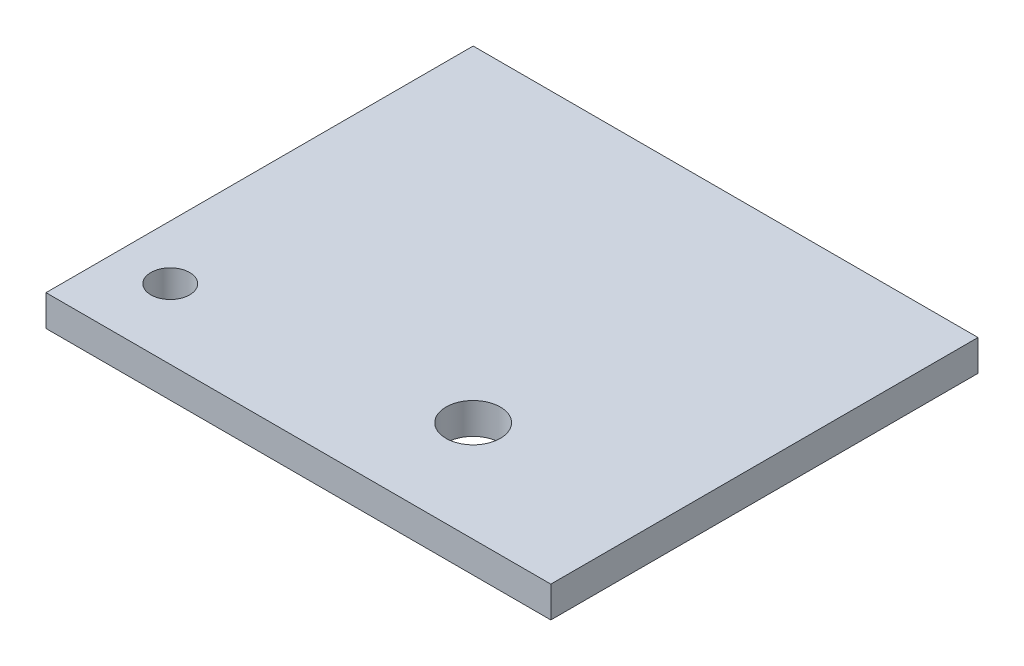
ISO-10303-21;
HEADER;
FILE_DESCRIPTION(('STEP AP214'),'2;1');
FILE_NAME('part.step','',(''),(''),'','','');
FILE_SCHEMA(('AUTOMOTIVE_DESIGN { 1 0 10303 214 1 1 1 1 }'));
ENDSEC;
DATA;
#1=APPLICATION_CONTEXT('core data for automotive mechanical design processes');
#2=APPLICATION_PROTOCOL_DEFINITION('international standard','automotive_design',2000,#1);
#3=PRODUCT_CONTEXT('',#1,'mechanical');
#4=PRODUCT('Part','Part','',(#3));
#5=PRODUCT_RELATED_PRODUCT_CATEGORY('part','',(#4));
#6=PRODUCT_DEFINITION_FORMATION('','',#4);
#7=PRODUCT_DEFINITION_CONTEXT('part definition',#1,'design');
#8=PRODUCT_DEFINITION('design','',#6,#7);
#9=PRODUCT_DEFINITION_SHAPE('','',#8);
#10=(LENGTH_UNIT() NAMED_UNIT(*) SI_UNIT(.MILLI.,.METRE.));
#11=(NAMED_UNIT(*) PLANE_ANGLE_UNIT() SI_UNIT($,.RADIAN.));
#12=(NAMED_UNIT(*) SI_UNIT($,.STERADIAN.) SOLID_ANGLE_UNIT());
#13=UNCERTAINTY_MEASURE_WITH_UNIT(LENGTH_MEASURE(1.E-05),#10,'distance_accuracy_value','');
#14=(GEOMETRIC_REPRESENTATION_CONTEXT(3) GLOBAL_UNCERTAINTY_ASSIGNED_CONTEXT((#13)) GLOBAL_UNIT_ASSIGNED_CONTEXT((#10,
#11,#12)) REPRESENTATION_CONTEXT('',''));
#15=CARTESIAN_POINT('',(0.,0.,0.));
#16=DIRECTION('',(0.,0.,1.));
#17=DIRECTION('',(1.,0.,0.));
#18=AXIS2_PLACEMENT_3D('',#15,#16,#17);
#19=CARTESIAN_POINT('',(0.,20.,0.));
#20=DIRECTION('',(1.,0.,0.));
#21=DIRECTION('',(0.,0.,-1.));
#22=AXIS2_PLACEMENT_3D('',#19,#20,#21);
#23=PLANE('',#22);
#24=DIRECTION('',(0.,0.,1.));
#25=VECTOR('',#24,1.);
#26=CARTESIAN_POINT('',(0.,0.,0.));
#27=LINE('',#26,#25);
#28=CARTESIAN_POINT('',(0.,0.,-275.));
#29=VERTEX_POINT('',#28);
#30=CARTESIAN_POINT('',(0.,0.,0.));
#31=VERTEX_POINT('',#30);
#32=EDGE_CURVE('E72',#29,#31,#27,.T.);
#33=ORIENTED_EDGE('',*,*,#32,.T.);
#34=DIRECTION('',(0.,-1.,0.));
#35=VECTOR('',#34,1.);
#36=CARTESIAN_POINT('',(0.,20.,0.));
#37=LINE('',#36,#35);
#38=CARTESIAN_POINT('',(0.,20.,0.));
#39=VERTEX_POINT('',#38);
#40=EDGE_CURVE('E11',#39,#31,#37,.T.);
#41=ORIENTED_EDGE('',*,*,#40,.F.);
#42=DIRECTION('',(0.,0.,1.));
#43=VECTOR('',#42,1.);
#44=CARTESIAN_POINT('',(0.,20.,0.));
#45=LINE('',#44,#43);
#46=CARTESIAN_POINT('',(0.,20.,-275.));
#47=VERTEX_POINT('',#46);
#48=EDGE_CURVE('E95',#47,#39,#45,.T.);
#49=ORIENTED_EDGE('',*,*,#48,.F.);
#50=DIRECTION('',(0.,-1.,0.));
#51=VECTOR('',#50,1.);
#52=CARTESIAN_POINT('',(0.,20.,-275.));
#53=LINE('',#52,#51);
#54=EDGE_CURVE('E84',#47,#29,#53,.T.);
#55=ORIENTED_EDGE('',*,*,#54,.T.);
#56=EDGE_LOOP('',(#33,#41,#49,#55));
#57=FACE_BOUND('',#56,.T.);
#58=ADVANCED_FACE('F28',(#57),#23,.F.);
#59=CARTESIAN_POINT('',(0.,20.,0.));
#60=DIRECTION('',(0.,0.,-1.));
#61=DIRECTION('',(-1.,0.,0.));
#62=AXIS2_PLACEMENT_3D('',#59,#60,#61);
#63=PLANE('',#62);
#64=DIRECTION('',(1.,0.,0.));
#65=VECTOR('',#64,1.);
#66=CARTESIAN_POINT('',(0.,0.,0.));
#67=LINE('',#66,#65);
#68=CARTESIAN_POINT('',(325.,0.,0.));
#69=VERTEX_POINT('',#68);
#70=EDGE_CURVE('E68',#31,#69,#67,.T.);
#71=ORIENTED_EDGE('',*,*,#70,.T.);
#72=DIRECTION('',(0.,-1.,0.));
#73=VECTOR('',#72,1.);
#74=CARTESIAN_POINT('',(325.,20.,0.));
#75=LINE('',#74,#73);
#76=CARTESIAN_POINT('',(325.,20.,0.));
#77=VERTEX_POINT('',#76);
#78=EDGE_CURVE('E35',#77,#69,#75,.T.);
#79=ORIENTED_EDGE('',*,*,#78,.F.);
#80=DIRECTION('',(1.,0.,0.));
#81=VECTOR('',#80,1.);
#82=CARTESIAN_POINT('',(0.,20.,0.));
#83=LINE('',#82,#81);
#84=EDGE_CURVE('E80',#39,#77,#83,.T.);
#85=ORIENTED_EDGE('',*,*,#84,.F.);
#86=ORIENTED_EDGE('',*,*,#40,.T.);
#87=EDGE_LOOP('',(#71,#79,#85,#86));
#88=FACE_BOUND('',#87,.T.);
#89=ADVANCED_FACE('F79',(#88),#63,.F.);
#90=CARTESIAN_POINT('',(325.,20.,0.));
#91=DIRECTION('',(-1.,0.,0.));
#92=DIRECTION('',(0.,0.,1.));
#93=AXIS2_PLACEMENT_3D('',#90,#91,#92);
#94=PLANE('',#93);
#95=DIRECTION('',(0.,0.,-1.));
#96=VECTOR('',#95,1.);
#97=CARTESIAN_POINT('',(325.,0.,0.));
#98=LINE('',#97,#96);
#99=CARTESIAN_POINT('',(325.,0.,-275.));
#100=VERTEX_POINT('',#99);
#101=EDGE_CURVE('E73',#69,#100,#98,.T.);
#102=ORIENTED_EDGE('',*,*,#101,.T.);
#103=DIRECTION('',(0.,-1.,0.));
#104=VECTOR('',#103,1.);
#105=CARTESIAN_POINT('',(325.,20.,-275.));
#106=LINE('',#105,#104);
#107=CARTESIAN_POINT('',(325.,20.,-275.));
#108=VERTEX_POINT('',#107);
#109=EDGE_CURVE('E101',#108,#100,#106,.T.);
#110=ORIENTED_EDGE('',*,*,#109,.F.);
#111=DIRECTION('',(0.,0.,-1.));
#112=VECTOR('',#111,1.);
#113=CARTESIAN_POINT('',(325.,20.,0.));
#114=LINE('',#113,#112);
#115=EDGE_CURVE('E47',#77,#108,#114,.T.);
#116=ORIENTED_EDGE('',*,*,#115,.F.);
#117=ORIENTED_EDGE('',*,*,#78,.T.);
#118=EDGE_LOOP('',(#102,#110,#116,#117));
#119=FACE_BOUND('',#118,.T.);
#120=ADVANCED_FACE('F104',(#119),#94,.F.);
#121=CARTESIAN_POINT('',(0.,20.,-275.));
#122=DIRECTION('',(0.,0.,1.));
#123=DIRECTION('',(1.,0.,0.));
#124=AXIS2_PLACEMENT_3D('',#121,#122,#123);
#125=PLANE('',#124);
#126=DIRECTION('',(-1.,0.,0.));
#127=VECTOR('',#126,1.);
#128=CARTESIAN_POINT('',(0.,0.,-275.));
#129=LINE('',#128,#127);
#130=EDGE_CURVE('E93',#100,#29,#129,.T.);
#131=ORIENTED_EDGE('',*,*,#130,.T.);
#132=ORIENTED_EDGE('',*,*,#54,.F.);
#133=DIRECTION('',(-1.,0.,0.));
#134=VECTOR('',#133,1.);
#135=CARTESIAN_POINT('',(0.,20.,-275.));
#136=LINE('',#135,#134);
#137=EDGE_CURVE('E42',#108,#47,#136,.T.);
#138=ORIENTED_EDGE('',*,*,#137,.F.);
#139=ORIENTED_EDGE('',*,*,#109,.T.);
#140=EDGE_LOOP('',(#131,#132,#138,#139));
#141=FACE_BOUND('',#140,.T.);
#142=ADVANCED_FACE('F106',(#141),#125,.F.);
#143=CARTESIAN_POINT('',(0.,20.,-275.));
#144=DIRECTION('',(0.,-1.,0.));
#145=DIRECTION('',(0.,0.,-1.));
#146=AXIS2_PLACEMENT_3D('',#143,#144,#145);
#147=PLANE('',#146);
#148=CARTESIAN_POINT('',(210.,19.9999999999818,-65.));
#149=DIRECTION('',(0.,1.,0.));
#150=DIRECTION('',(0.,0.,1.));
#151=AXIS2_PLACEMENT_3D('',#148,#149,#150);
#152=CIRCLE('',#151,17.5);
#153=CARTESIAN_POINT('',(210.,19.9999999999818,-47.5));
#154=VERTEX_POINT('',#153);
#155=EDGE_CURVE('E161',#154,#154,#152,.T.);
#156=ORIENTED_EDGE('',*,*,#155,.F.);
#157=EDGE_LOOP('',(#156));
#158=FACE_BOUND('',#157,.T.);
#159=CARTESIAN_POINT('',(35.,20.,-45.));
#160=DIRECTION('',(0.,1.,0.));
#161=DIRECTION('',(0.,0.,1.));
#162=AXIS2_PLACEMENT_3D('',#159,#160,#161);
#163=CIRCLE('',#162,12.5);
#164=CARTESIAN_POINT('',(35.,20.,-32.5));
#165=VERTEX_POINT('',#164);
#166=EDGE_CURVE('E88',#165,#165,#163,.T.);
#167=ORIENTED_EDGE('',*,*,#166,.F.);
#168=EDGE_LOOP('',(#167));
#169=FACE_BOUND('',#168,.T.);
#170=ORIENTED_EDGE('',*,*,#48,.T.);
#171=ORIENTED_EDGE('',*,*,#84,.T.);
#172=ORIENTED_EDGE('',*,*,#115,.T.);
#173=ORIENTED_EDGE('',*,*,#137,.T.);
#174=EDGE_LOOP('',(#170,#171,#172,#173));
#175=FACE_BOUND('',#174,.T.);
#176=ADVANCED_FACE('F107',(#158,#169,#175),#147,.F.);
#177=CARTESIAN_POINT('',(0.,0.,-275.));
#178=DIRECTION('',(0.,-1.,0.));
#179=DIRECTION('',(0.,0.,-1.));
#180=AXIS2_PLACEMENT_3D('',#177,#178,#179);
#181=PLANE('',#180);
#182=CARTESIAN_POINT('',(210.,0.,-65.));
#183=DIRECTION('',(0.,1.,0.));
#184=DIRECTION('',(0.,0.,1.));
#185=AXIS2_PLACEMENT_3D('',#182,#183,#184);
#186=CIRCLE('',#185,17.5);
#187=CARTESIAN_POINT('',(210.,0.,-47.5));
#188=VERTEX_POINT('',#187);
#189=EDGE_CURVE('E159',#188,#188,#186,.T.);
#190=ORIENTED_EDGE('',*,*,#189,.T.);
#191=EDGE_LOOP('',(#190));
#192=FACE_BOUND('',#191,.T.);
#193=CARTESIAN_POINT('',(35.,0.,-45.));
#194=DIRECTION('',(0.,1.,0.));
#195=DIRECTION('',(0.,0.,1.));
#196=AXIS2_PLACEMENT_3D('',#193,#194,#195);
#197=CIRCLE('',#196,12.5);
#198=CARTESIAN_POINT('',(35.,0.,-32.5));
#199=VERTEX_POINT('',#198);
#200=EDGE_CURVE('E85',#199,#199,#197,.T.);
#201=ORIENTED_EDGE('',*,*,#200,.T.);
#202=EDGE_LOOP('',(#201));
#203=FACE_BOUND('',#202,.T.);
#204=ORIENTED_EDGE('',*,*,#32,.F.);
#205=ORIENTED_EDGE('',*,*,#130,.F.);
#206=ORIENTED_EDGE('',*,*,#101,.F.);
#207=ORIENTED_EDGE('',*,*,#70,.F.);
#208=EDGE_LOOP('',(#204,#205,#206,#207));
#209=FACE_BOUND('',#208,.T.);
#210=ADVANCED_FACE('F69',(#192,#203,#209),#181,.T.);
#211=CARTESIAN_POINT('',(35.,0.,-45.));
#212=DIRECTION('',(0.,1.,0.));
#213=DIRECTION('',(0.,0.,1.));
#214=AXIS2_PLACEMENT_3D('',#211,#212,#213);
#215=CYLINDRICAL_SURFACE('',#214,12.5);
#216=ORIENTED_EDGE('',*,*,#200,.F.);
#217=EDGE_LOOP('',(#216));
#218=FACE_BOUND('',#217,.T.);
#219=ORIENTED_EDGE('',*,*,#166,.T.);
#220=EDGE_LOOP('',(#219));
#221=FACE_BOUND('',#220,.T.);
#222=ADVANCED_FACE('F115',(#218,#221),#215,.F.);
#223=CARTESIAN_POINT('',(210.,0.,-65.));
#224=DIRECTION('',(0.,1.,0.));
#225=DIRECTION('',(0.,0.,1.));
#226=AXIS2_PLACEMENT_3D('',#223,#224,#225);
#227=CYLINDRICAL_SURFACE('',#226,17.5);
#228=ORIENTED_EDGE('',*,*,#189,.F.);
#229=EDGE_LOOP('',(#228));
#230=FACE_BOUND('',#229,.T.);
#231=ORIENTED_EDGE('',*,*,#155,.T.);
#232=EDGE_LOOP('',(#231));
#233=FACE_BOUND('',#232,.T.);
#234=ADVANCED_FACE('F140',(#230,#233),#227,.F.);
#235=CLOSED_SHELL('',(#58,#89,#120,#142,#176,#210,#222,#234));
#236=MANIFOLD_SOLID_BREP('B2',#235);
#237=ADVANCED_BREP_SHAPE_REPRESENTATION('',(#18,#236),#14);
#238=SHAPE_DEFINITION_REPRESENTATION(#9,#237);
ENDSEC;
END-ISO-10303-21;
